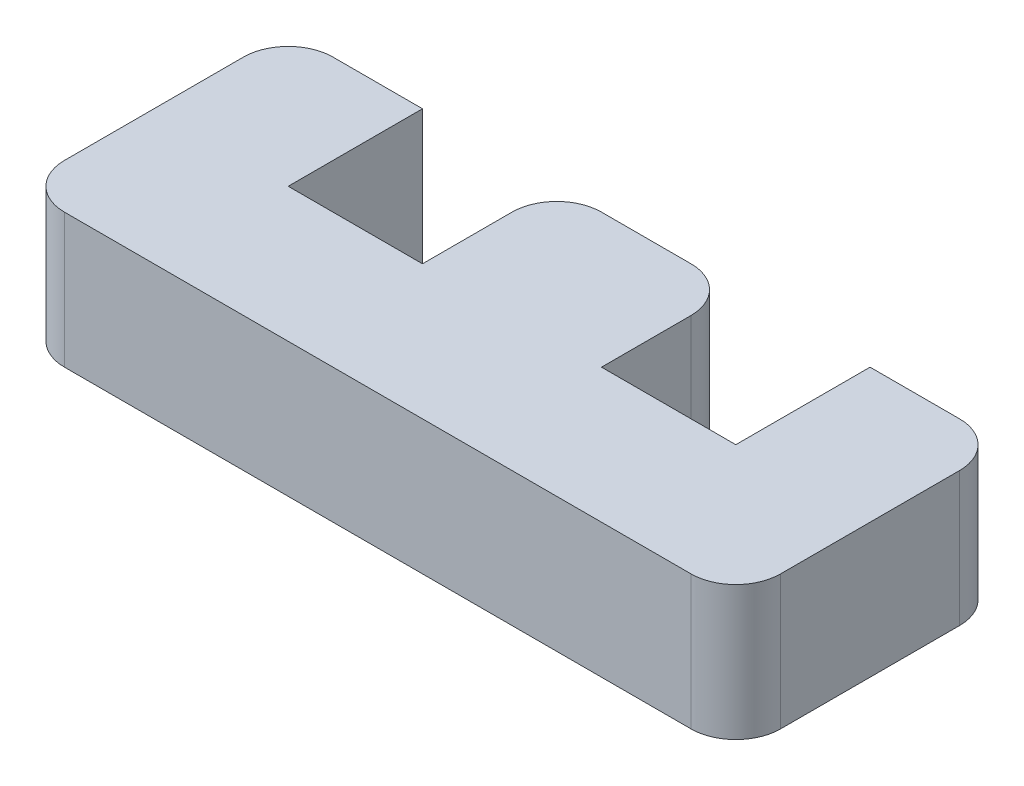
from build123d import *

# Parameters (mm, degrees)
EXTRUDE_1_DEPTH = 3
FILLET_1_R      = 1


with BuildPart() as part:
    # Sketch 1 → Extrude 1 (new body)
    with BuildSketch(Plane(origin=(0, 0, 0), x_dir=(1, 0, 0), z_dir=(0, 1, 0))):
        Polygon((0, 0), (0, -6), (16, -6), (16, 0), (13, 0), (13, -3), (10, -3), (10, 0), (6, 0), (6, -3), (3, -3), (3, 0), align=None)
    extrude(amount=EXTRUDE_1_DEPTH)

    # Fillet 1
    fillet_1_edges = [part.edges().sort_by_distance(p)[0] for p in [
        (6, 1.5, 0),
        (10, 1.5, 0),
        (16, 1.5, 0),
        (16, 1.5, 6),
        (0, 1.5, 6),
        (0, 1.5, 0),
    ]]
    fillet(fillet_1_edges, radius=FILLET_1_R)


solid = part.part
